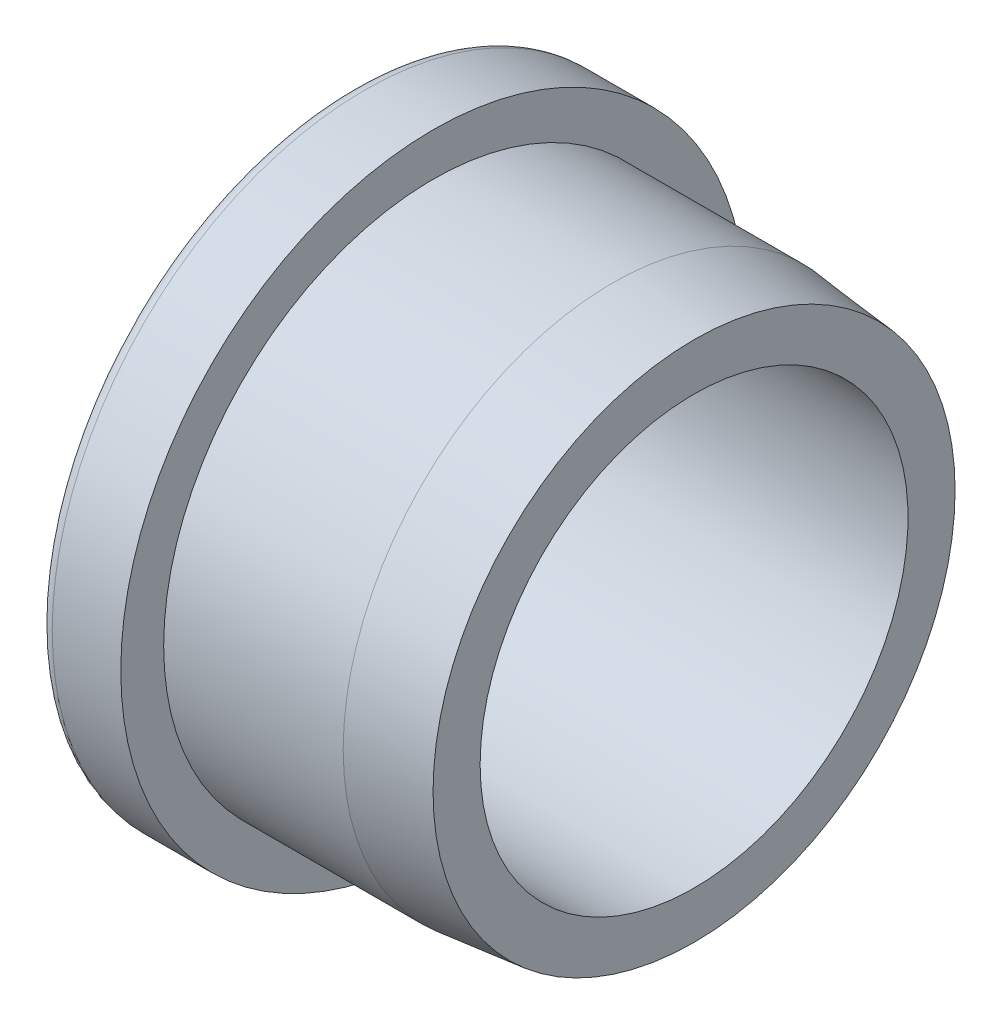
ISO-10303-21;
HEADER;
FILE_DESCRIPTION(('STEP AP214'),'2;1');
FILE_NAME('part.step','',(''),(''),'','','');
FILE_SCHEMA(('AUTOMOTIVE_DESIGN { 1 0 10303 214 1 1 1 1 }'));
ENDSEC;
DATA;
#1=APPLICATION_CONTEXT('core data for automotive mechanical design processes');
#2=APPLICATION_PROTOCOL_DEFINITION('international standard','automotive_design',2000,#1);
#3=PRODUCT_CONTEXT('',#1,'mechanical');
#4=PRODUCT('Part','Part','',(#3));
#5=PRODUCT_RELATED_PRODUCT_CATEGORY('part','',(#4));
#6=PRODUCT_DEFINITION_FORMATION('','',#4);
#7=PRODUCT_DEFINITION_CONTEXT('part definition',#1,'design');
#8=PRODUCT_DEFINITION('design','',#6,#7);
#9=PRODUCT_DEFINITION_SHAPE('','',#8);
#10=(LENGTH_UNIT() NAMED_UNIT(*) SI_UNIT(.MILLI.,.METRE.));
#11=(NAMED_UNIT(*) PLANE_ANGLE_UNIT() SI_UNIT($,.RADIAN.));
#12=(NAMED_UNIT(*) SI_UNIT($,.STERADIAN.) SOLID_ANGLE_UNIT());
#13=UNCERTAINTY_MEASURE_WITH_UNIT(LENGTH_MEASURE(1.E-05),#10,'distance_accuracy_value','');
#14=(GEOMETRIC_REPRESENTATION_CONTEXT(3) GLOBAL_UNCERTAINTY_ASSIGNED_CONTEXT((#13)) GLOBAL_UNIT_ASSIGNED_CONTEXT((#10,
#11,#12)) REPRESENTATION_CONTEXT('',''));
#15=CARTESIAN_POINT('',(0.,0.,0.));
#16=DIRECTION('',(0.,0.,1.));
#17=DIRECTION('',(1.,0.,0.));
#18=AXIS2_PLACEMENT_3D('',#15,#16,#17);
#19=CARTESIAN_POINT('',(0.,5.,0.));
#20=DIRECTION('',(-1.,0.,0.));
#21=DIRECTION('',(0.,0.,1.));
#22=AXIS2_PLACEMENT_3D('',#19,#20,#21);
#23=PLANE('',#22);
#24=CARTESIAN_POINT('',(0.,0.,0.));
#25=DIRECTION('',(-1.,0.,0.));
#26=DIRECTION('',(0.,0.,1.));
#27=AXIS2_PLACEMENT_3D('',#24,#25,#26);
#28=CIRCLE('',#27,5.3);
#29=CARTESIAN_POINT('',(0.,0.,5.3));
#30=VERTEX_POINT('',#29);
#31=EDGE_CURVE('E35',#30,#30,#28,.F.);
#32=ORIENTED_EDGE('',*,*,#31,.T.);
#33=EDGE_LOOP('',(#32));
#34=FACE_BOUND('',#33,.T.);
#35=CARTESIAN_POINT('',(0.,0.,0.));
#36=DIRECTION('',(-1.,0.,0.));
#37=DIRECTION('',(0.,0.,1.));
#38=AXIS2_PLACEMENT_3D('',#35,#36,#37);
#39=CIRCLE('',#38,7.00000000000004);
#40=CARTESIAN_POINT('',(0.,0.,7.00000000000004));
#41=VERTEX_POINT('',#40);
#42=EDGE_CURVE('E39',#41,#41,#39,.T.);
#43=ORIENTED_EDGE('',*,*,#42,.T.);
#44=EDGE_LOOP('',(#43));
#45=FACE_BOUND('',#44,.T.);
#46=ADVANCED_FACE('F29',(#34,#45),#23,.T.);
#47=CARTESIAN_POINT('',(-1.1,0.,0.));
#48=DIRECTION('',(-1.,0.,0.));
#49=DIRECTION('',(0.,0.,1.));
#50=AXIS2_PLACEMENT_3D('',#47,#48,#49);
#51=CYLINDRICAL_SURFACE('',#50,7.30000000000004);
#52=CARTESIAN_POINT('',(0.3,0.,0.));
#53=DIRECTION('',(-1.,0.,0.));
#54=DIRECTION('',(0.,0.,1.));
#55=AXIS2_PLACEMENT_3D('',#52,#53,#54);
#56=CIRCLE('',#55,7.30000000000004);
#57=CARTESIAN_POINT('',(0.3,0.,7.30000000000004));
#58=VERTEX_POINT('',#57);
#59=EDGE_CURVE('E10',#58,#58,#56,.F.);
#60=ORIENTED_EDGE('',*,*,#59,.T.);
#61=EDGE_LOOP('',(#60));
#62=FACE_BOUND('',#61,.T.);
#63=CARTESIAN_POINT('',(1.90238230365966,0.,0.));
#64=DIRECTION('',(-1.,0.,0.));
#65=DIRECTION('',(0.,0.,1.));
#66=AXIS2_PLACEMENT_3D('',#63,#64,#65);
#67=CIRCLE('',#66,7.30000000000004);
#68=CARTESIAN_POINT('',(1.90238230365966,0.,7.30000000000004));
#69=VERTEX_POINT('',#68);
#70=EDGE_CURVE('E48',#69,#69,#67,.T.);
#71=ORIENTED_EDGE('',*,*,#70,.T.);
#72=EDGE_LOOP('',(#71));
#73=FACE_BOUND('',#72,.T.);
#74=ADVANCED_FACE('F82',(#62,#73),#51,.T.);
#75=CARTESIAN_POINT('',(1.90238230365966,7.30000000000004,0.));
#76=DIRECTION('',(1.,0.,0.));
#77=DIRECTION('',(0.,0.,-1.));
#78=AXIS2_PLACEMENT_3D('',#75,#76,#77);
#79=PLANE('',#78);
#80=CARTESIAN_POINT('',(1.90238230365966,0.,0.));
#81=DIRECTION('',(-1.,0.,0.));
#82=DIRECTION('',(0.,0.,1.));
#83=AXIS2_PLACEMENT_3D('',#80,#81,#82);
#84=CIRCLE('',#83,6.29780169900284);
#85=CARTESIAN_POINT('',(1.90238230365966,0.,6.29780169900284));
#86=VERTEX_POINT('',#85);
#87=EDGE_CURVE('E51',#86,#86,#84,.T.);
#88=ORIENTED_EDGE('',*,*,#87,.T.);
#89=EDGE_LOOP('',(#88));
#90=FACE_BOUND('',#89,.T.);
#91=ORIENTED_EDGE('',*,*,#70,.F.);
#92=EDGE_LOOP('',(#91));
#93=FACE_BOUND('',#92,.T.);
#94=ADVANCED_FACE('F86',(#90,#93),#79,.T.);
#95=CARTESIAN_POINT('',(-1.1,0.,0.));
#96=DIRECTION('',(-1.,0.,0.));
#97=DIRECTION('',(0.,0.,1.));
#98=AXIS2_PLACEMENT_3D('',#95,#96,#97);
#99=CYLINDRICAL_SURFACE('',#98,6.29780169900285);
#100=CARTESIAN_POINT('',(6.09761769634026,0.,0.));
#101=DIRECTION('',(-1.,0.,0.));
#102=DIRECTION('',(0.,0.,1.));
#103=AXIS2_PLACEMENT_3D('',#100,#101,#102);
#104=CIRCLE('',#103,6.29780169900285);
#105=CARTESIAN_POINT('',(6.09761769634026,0.,6.29780169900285));
#106=VERTEX_POINT('',#105);
#107=EDGE_CURVE('E54',#106,#106,#104,.T.);
#108=ORIENTED_EDGE('',*,*,#107,.T.);
#109=EDGE_LOOP('',(#108));
#110=FACE_BOUND('',#109,.T.);
#111=ORIENTED_EDGE('',*,*,#87,.F.);
#112=EDGE_LOOP('',(#111));
#113=FACE_BOUND('',#112,.T.);
#114=ADVANCED_FACE('F118',(#110,#113),#99,.T.);
#115=CARTESIAN_POINT('',(6.09761769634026,0.,0.));
#116=DIRECTION('',(-1.,0.,0.));
#117=DIRECTION('',(0.,0.,1.));
#118=AXIS2_PLACEMENT_3D('',#115,#116,#117);
#119=CONICAL_SURFACE('',#118,6.29780169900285,0.103603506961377);
#120=CARTESIAN_POINT('',(8.,0.,0.));
#121=DIRECTION('',(-1.,0.,0.));
#122=DIRECTION('',(0.,0.,1.));
#123=AXIS2_PLACEMENT_3D('',#120,#121,#122);
#124=CIRCLE('',#123,6.1);
#125=CARTESIAN_POINT('',(8.,0.,6.1));
#126=VERTEX_POINT('',#125);
#127=EDGE_CURVE('E57',#126,#126,#124,.T.);
#128=ORIENTED_EDGE('',*,*,#127,.T.);
#129=EDGE_LOOP('',(#128));
#130=FACE_BOUND('',#129,.T.);
#131=ORIENTED_EDGE('',*,*,#107,.F.);
#132=EDGE_LOOP('',(#131));
#133=FACE_BOUND('',#132,.T.);
#134=ADVANCED_FACE('F79',(#130,#133),#119,.T.);
#135=CARTESIAN_POINT('',(8.,6.1,0.));
#136=DIRECTION('',(1.,0.,0.));
#137=DIRECTION('',(0.,0.,-1.));
#138=AXIS2_PLACEMENT_3D('',#135,#136,#137);
#139=PLANE('',#138);
#140=CARTESIAN_POINT('',(8.,0.,0.));
#141=DIRECTION('',(-1.,0.,0.));
#142=DIRECTION('',(0.,0.,1.));
#143=AXIS2_PLACEMENT_3D('',#140,#141,#142);
#144=CIRCLE('',#143,5.);
#145=CARTESIAN_POINT('',(8.,0.,5.));
#146=VERTEX_POINT('',#145);
#147=EDGE_CURVE('E60',#146,#146,#144,.T.);
#148=ORIENTED_EDGE('',*,*,#147,.T.);
#149=EDGE_LOOP('',(#148));
#150=FACE_BOUND('',#149,.T.);
#151=ORIENTED_EDGE('',*,*,#127,.F.);
#152=EDGE_LOOP('',(#151));
#153=FACE_BOUND('',#152,.T.);
#154=ADVANCED_FACE('F64',(#150,#153),#139,.T.);
#155=CARTESIAN_POINT('',(-1.1,0.,0.));
#156=DIRECTION('',(-1.,0.,0.));
#157=DIRECTION('',(0.,0.,1.));
#158=AXIS2_PLACEMENT_3D('',#155,#156,#157);
#159=CYLINDRICAL_SURFACE('',#158,5.);
#160=CARTESIAN_POINT('',(0.3,0.,0.));
#161=DIRECTION('',(-1.,0.,0.));
#162=DIRECTION('',(0.,0.,1.));
#163=AXIS2_PLACEMENT_3D('',#160,#161,#162);
#164=CIRCLE('',#163,5.);
#165=CARTESIAN_POINT('',(0.3,0.,5.));
#166=VERTEX_POINT('',#165);
#167=EDGE_CURVE('E43',#166,#166,#164,.T.);
#168=ORIENTED_EDGE('',*,*,#167,.T.);
#169=EDGE_LOOP('',(#168));
#170=FACE_BOUND('',#169,.T.);
#171=ORIENTED_EDGE('',*,*,#147,.F.);
#172=EDGE_LOOP('',(#171));
#173=FACE_BOUND('',#172,.T.);
#174=ADVANCED_FACE('F67',(#170,#173),#159,.F.);
#175=CARTESIAN_POINT('',(0.3,0.,0.));
#176=DIRECTION('',(-1.,0.,0.));
#177=DIRECTION('',(0.,0.,1.));
#178=AXIS2_PLACEMENT_3D('',#175,#176,#177);
#179=TOROIDAL_SURFACE('',#178,5.3,0.3);
#180=ORIENTED_EDGE('',*,*,#31,.F.);
#181=EDGE_LOOP('',(#180));
#182=FACE_BOUND('',#181,.T.);
#183=ORIENTED_EDGE('',*,*,#167,.F.);
#184=EDGE_LOOP('',(#183));
#185=FACE_BOUND('',#184,.T.);
#186=ADVANCED_FACE('F69',(#182,#185),#179,.T.);
#187=CARTESIAN_POINT('',(0.3,0.,0.));
#188=DIRECTION('',(-1.,0.,0.));
#189=DIRECTION('',(0.,0.,1.));
#190=AXIS2_PLACEMENT_3D('',#187,#188,#189);
#191=TOROIDAL_SURFACE('',#190,7.00000000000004,0.3);
#192=ORIENTED_EDGE('',*,*,#59,.F.);
#193=EDGE_LOOP('',(#192));
#194=FACE_BOUND('',#193,.T.);
#195=ORIENTED_EDGE('',*,*,#42,.F.);
#196=EDGE_LOOP('',(#195));
#197=FACE_BOUND('',#196,.T.);
#198=ADVANCED_FACE('F76',(#194,#197),#191,.T.);
#199=CLOSED_SHELL('',(#46,#74,#94,#114,#134,#154,#174,#186,#198));
#200=MANIFOLD_SOLID_BREP('B2',#199);
#201=ADVANCED_BREP_SHAPE_REPRESENTATION('',(#18,#200),#14);
#202=SHAPE_DEFINITION_REPRESENTATION(#9,#201);
ENDSEC;
END-ISO-10303-21;
